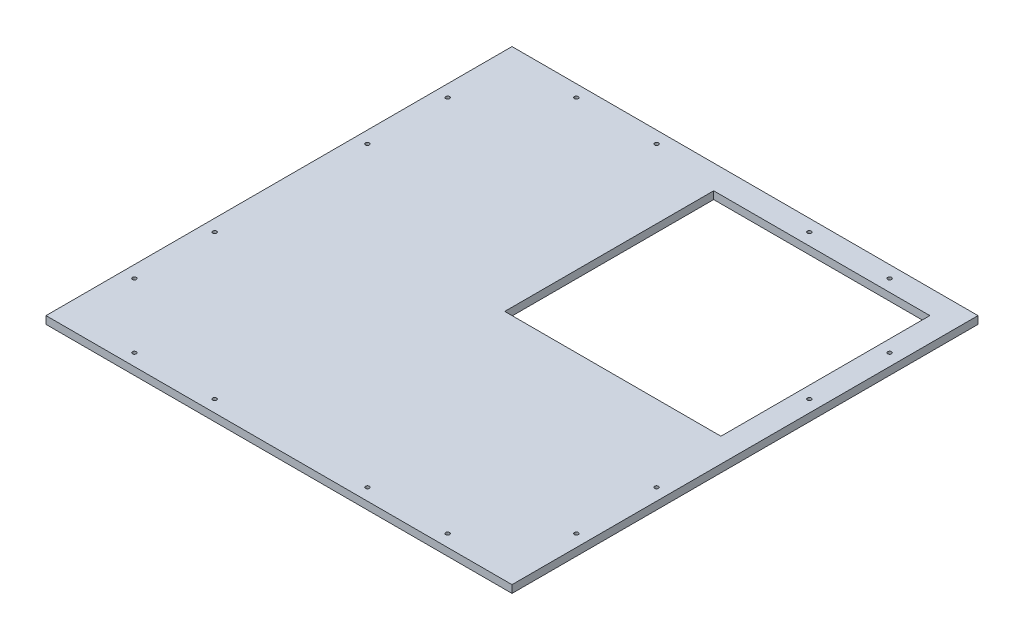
ISO-10303-21;
HEADER;
FILE_DESCRIPTION(('STEP AP214'),'2;1');
FILE_NAME('part.step','',(''),(''),'','','');
FILE_SCHEMA(('AUTOMOTIVE_DESIGN { 1 0 10303 214 1 1 1 1 }'));
ENDSEC;
DATA;
#1=APPLICATION_CONTEXT('core data for automotive mechanical design processes');
#2=APPLICATION_PROTOCOL_DEFINITION('international standard','automotive_design',2000,#1);
#3=PRODUCT_CONTEXT('',#1,'mechanical');
#4=PRODUCT('Part','Part','',(#3));
#5=PRODUCT_RELATED_PRODUCT_CATEGORY('part','',(#4));
#6=PRODUCT_DEFINITION_FORMATION('','',#4);
#7=PRODUCT_DEFINITION_CONTEXT('part definition',#1,'design');
#8=PRODUCT_DEFINITION('design','',#6,#7);
#9=PRODUCT_DEFINITION_SHAPE('','',#8);
#10=(LENGTH_UNIT() NAMED_UNIT(*) SI_UNIT(.MILLI.,.METRE.));
#11=(NAMED_UNIT(*) PLANE_ANGLE_UNIT() SI_UNIT($,.RADIAN.));
#12=(NAMED_UNIT(*) SI_UNIT($,.STERADIAN.) SOLID_ANGLE_UNIT());
#13=UNCERTAINTY_MEASURE_WITH_UNIT(LENGTH_MEASURE(1.E-05),#10,'distance_accuracy_value','');
#14=(GEOMETRIC_REPRESENTATION_CONTEXT(3) GLOBAL_UNCERTAINTY_ASSIGNED_CONTEXT((#13)) GLOBAL_UNIT_ASSIGNED_CONTEXT((#10,
#11,#12)) REPRESENTATION_CONTEXT('',''));
#15=CARTESIAN_POINT('',(0.,0.,0.));
#16=DIRECTION('',(0.,0.,1.));
#17=DIRECTION('',(1.,0.,0.));
#18=AXIS2_PLACEMENT_3D('',#15,#16,#17);
#19=CARTESIAN_POINT('',(0.,20.,0.));
#20=DIRECTION('',(1.,0.,0.));
#21=DIRECTION('',(0.,0.,-1.));
#22=AXIS2_PLACEMENT_3D('',#19,#20,#21);
#23=PLANE('',#22);
#24=DIRECTION('',(0.,0.,1.));
#25=VECTOR('',#24,1.);
#26=CARTESIAN_POINT('',(0.,0.,0.));
#27=LINE('',#26,#25);
#28=CARTESIAN_POINT('',(0.,0.,-1220.));
#29=VERTEX_POINT('',#28);
#30=CARTESIAN_POINT('',(0.,0.,0.));
#31=VERTEX_POINT('',#30);
#32=EDGE_CURVE('E136',#29,#31,#27,.T.);
#33=ORIENTED_EDGE('',*,*,#32,.T.);
#34=DIRECTION('',(0.,-1.,0.));
#35=VECTOR('',#34,1.);
#36=CARTESIAN_POINT('',(0.,20.,0.));
#37=LINE('',#36,#35);
#38=CARTESIAN_POINT('',(0.,20.,0.));
#39=VERTEX_POINT('',#38);
#40=EDGE_CURVE('E11',#39,#31,#37,.T.);
#41=ORIENTED_EDGE('',*,*,#40,.F.);
#42=DIRECTION('',(0.,0.,1.));
#43=VECTOR('',#42,1.);
#44=CARTESIAN_POINT('',(0.,20.,0.));
#45=LINE('',#44,#43);
#46=CARTESIAN_POINT('',(0.,20.,-1220.));
#47=VERTEX_POINT('',#46);
#48=EDGE_CURVE('E140',#47,#39,#45,.T.);
#49=ORIENTED_EDGE('',*,*,#48,.F.);
#50=DIRECTION('',(0.,-1.,0.));
#51=VECTOR('',#50,1.);
#52=CARTESIAN_POINT('',(0.,20.,-1220.));
#53=LINE('',#52,#51);
#54=EDGE_CURVE('E150',#47,#29,#53,.T.);
#55=ORIENTED_EDGE('',*,*,#54,.T.);
#56=EDGE_LOOP('',(#33,#41,#49,#55));
#57=FACE_BOUND('',#56,.T.);
#58=ADVANCED_FACE('F35',(#57),#23,.F.);
#59=CARTESIAN_POINT('',(0.,20.,0.));
#60=DIRECTION('',(0.,0.,-1.));
#61=DIRECTION('',(-1.,0.,0.));
#62=AXIS2_PLACEMENT_3D('',#59,#60,#61);
#63=PLANE('',#62);
#64=DIRECTION('',(1.,0.,0.));
#65=VECTOR('',#64,1.);
#66=CARTESIAN_POINT('',(0.,0.,0.));
#67=LINE('',#66,#65);
#68=CARTESIAN_POINT('',(1220.,0.,0.));
#69=VERTEX_POINT('',#68);
#70=EDGE_CURVE('E153',#31,#69,#67,.T.);
#71=ORIENTED_EDGE('',*,*,#70,.T.);
#72=DIRECTION('',(0.,-1.,0.));
#73=VECTOR('',#72,1.);
#74=CARTESIAN_POINT('',(1220.,20.,0.));
#75=LINE('',#74,#73);
#76=CARTESIAN_POINT('',(1220.,20.,0.));
#77=VERTEX_POINT('',#76);
#78=EDGE_CURVE('E42',#77,#69,#75,.T.);
#79=ORIENTED_EDGE('',*,*,#78,.F.);
#80=DIRECTION('',(1.,0.,0.));
#81=VECTOR('',#80,1.);
#82=CARTESIAN_POINT('',(0.,20.,0.));
#83=LINE('',#82,#81);
#84=EDGE_CURVE('E143',#39,#77,#83,.T.);
#85=ORIENTED_EDGE('',*,*,#84,.F.);
#86=ORIENTED_EDGE('',*,*,#40,.T.);
#87=EDGE_LOOP('',(#71,#79,#85,#86));
#88=FACE_BOUND('',#87,.T.);
#89=ADVANCED_FACE('F181',(#88),#63,.F.);
#90=CARTESIAN_POINT('',(1220.,20.,0.));
#91=DIRECTION('',(-1.,0.,0.));
#92=DIRECTION('',(0.,0.,1.));
#93=AXIS2_PLACEMENT_3D('',#90,#91,#92);
#94=PLANE('',#93);
#95=DIRECTION('',(0.,0.,-1.));
#96=VECTOR('',#95,1.);
#97=CARTESIAN_POINT('',(1220.,0.,0.));
#98=LINE('',#97,#96);
#99=CARTESIAN_POINT('',(1220.,0.,-1220.));
#100=VERTEX_POINT('',#99);
#101=EDGE_CURVE('E155',#69,#100,#98,.T.);
#102=ORIENTED_EDGE('',*,*,#101,.T.);
#103=DIRECTION('',(0.,-1.,0.));
#104=VECTOR('',#103,1.);
#105=CARTESIAN_POINT('',(1220.,20.,-1220.));
#106=LINE('',#105,#104);
#107=CARTESIAN_POINT('',(1220.,20.,-1220.));
#108=VERTEX_POINT('',#107);
#109=EDGE_CURVE('E160',#108,#100,#106,.T.);
#110=ORIENTED_EDGE('',*,*,#109,.F.);
#111=DIRECTION('',(0.,0.,-1.));
#112=VECTOR('',#111,1.);
#113=CARTESIAN_POINT('',(1220.,20.,0.));
#114=LINE('',#113,#112);
#115=EDGE_CURVE('E146',#77,#108,#114,.T.);
#116=ORIENTED_EDGE('',*,*,#115,.F.);
#117=ORIENTED_EDGE('',*,*,#78,.T.);
#118=EDGE_LOOP('',(#102,#110,#116,#117));
#119=FACE_BOUND('',#118,.T.);
#120=ADVANCED_FACE('F167',(#119),#94,.F.);
#121=CARTESIAN_POINT('',(0.,20.,-1220.));
#122=DIRECTION('',(0.,0.,1.));
#123=DIRECTION('',(1.,0.,0.));
#124=AXIS2_PLACEMENT_3D('',#121,#122,#123);
#125=PLANE('',#124);
#126=DIRECTION('',(-1.,0.,0.));
#127=VECTOR('',#126,1.);
#128=CARTESIAN_POINT('',(0.,0.,-1220.));
#129=LINE('',#128,#127);
#130=EDGE_CURVE('E144',#100,#29,#129,.T.);
#131=ORIENTED_EDGE('',*,*,#130,.T.);
#132=ORIENTED_EDGE('',*,*,#54,.F.);
#133=DIRECTION('',(-1.,0.,0.));
#134=VECTOR('',#133,1.);
#135=CARTESIAN_POINT('',(0.,20.,-1220.));
#136=LINE('',#135,#134);
#137=EDGE_CURVE('E148',#108,#47,#136,.T.);
#138=ORIENTED_EDGE('',*,*,#137,.F.);
#139=ORIENTED_EDGE('',*,*,#109,.T.);
#140=EDGE_LOOP('',(#131,#132,#138,#139));
#141=FACE_BOUND('',#140,.T.);
#142=ADVANCED_FACE('F174',(#141),#125,.F.);
#143=CARTESIAN_POINT('',(0.,20.,0.));
#144=DIRECTION('',(0.,-1.,0.));
#145=DIRECTION('',(0.,0.,-1.));
#146=AXIS2_PLACEMENT_3D('',#143,#144,#145);
#147=PLANE('',#146);
#148=CARTESIAN_POINT('',(200.,20.,-1188.5));
#149=DIRECTION('',(0.,1.,0.));
#150=DIRECTION('',(0.,0.,1.));
#151=AXIS2_PLACEMENT_3D('',#148,#149,#150);
#152=CIRCLE('',#151,5.00000000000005);
#153=CARTESIAN_POINT('',(200.,20.,-1183.5));
#154=VERTEX_POINT('',#153);
#155=EDGE_CURVE('E321',#154,#154,#152,.T.);
#156=ORIENTED_EDGE('',*,*,#155,.F.);
#157=EDGE_LOOP('',(#156));
#158=FACE_BOUND('',#157,.T.);
#159=CARTESIAN_POINT('',(31.5,20.,-1020.));
#160=DIRECTION('',(0.,1.,0.));
#161=DIRECTION('',(0.,0.,1.));
#162=AXIS2_PLACEMENT_3D('',#159,#160,#161);
#163=CIRCLE('',#162,5.00000000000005);
#164=CARTESIAN_POINT('',(31.5,20.,-1015.));
#165=VERTEX_POINT('',#164);
#166=EDGE_CURVE('E327',#165,#165,#163,.T.);
#167=ORIENTED_EDGE('',*,*,#166,.F.);
#168=EDGE_LOOP('',(#167));
#169=FACE_BOUND('',#168,.T.);
#170=CARTESIAN_POINT('',(31.5,20.,-810.));
#171=DIRECTION('',(0.,1.,0.));
#172=DIRECTION('',(0.,0.,1.));
#173=AXIS2_PLACEMENT_3D('',#170,#171,#172);
#174=CIRCLE('',#173,5.00000000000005);
#175=CARTESIAN_POINT('',(31.5,20.,-805.));
#176=VERTEX_POINT('',#175);
#177=EDGE_CURVE('E333',#176,#176,#174,.T.);
#178=ORIENTED_EDGE('',*,*,#177,.F.);
#179=EDGE_LOOP('',(#178));
#180=FACE_BOUND('',#179,.T.);
#181=CARTESIAN_POINT('',(31.5,20.,-410.));
#182=DIRECTION('',(0.,1.,0.));
#183=DIRECTION('',(0.,0.,1.));
#184=AXIS2_PLACEMENT_3D('',#181,#182,#183);
#185=CIRCLE('',#184,5.00000000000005);
#186=CARTESIAN_POINT('',(31.5,20.,-405.));
#187=VERTEX_POINT('',#186);
#188=EDGE_CURVE('E339',#187,#187,#185,.T.);
#189=ORIENTED_EDGE('',*,*,#188,.F.);
#190=EDGE_LOOP('',(#189));
#191=FACE_BOUND('',#190,.T.);
#192=CARTESIAN_POINT('',(31.4999999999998,20.,-200.));
#193=DIRECTION('',(0.,1.,0.));
#194=DIRECTION('',(0.,0.,1.));
#195=AXIS2_PLACEMENT_3D('',#192,#193,#194);
#196=CIRCLE('',#195,4.99999999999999);
#197=CARTESIAN_POINT('',(31.4999999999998,20.,-195.));
#198=VERTEX_POINT('',#197);
#199=EDGE_CURVE('E345',#198,#198,#196,.T.);
#200=ORIENTED_EDGE('',*,*,#199,.F.);
#201=EDGE_LOOP('',(#200));
#202=FACE_BOUND('',#201,.T.);
#203=CARTESIAN_POINT('',(200.,20.,-31.5));
#204=DIRECTION('',(0.,1.,0.));
#205=DIRECTION('',(0.,0.,1.));
#206=AXIS2_PLACEMENT_3D('',#203,#204,#205);
#207=CIRCLE('',#206,4.99999999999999);
#208=CARTESIAN_POINT('',(200.,20.,-26.5));
#209=VERTEX_POINT('',#208);
#210=EDGE_CURVE('E351',#209,#209,#207,.T.);
#211=ORIENTED_EDGE('',*,*,#210,.F.);
#212=EDGE_LOOP('',(#211));
#213=FACE_BOUND('',#212,.T.);
#214=CARTESIAN_POINT('',(410.,20.,-31.5));
#215=DIRECTION('',(0.,1.,0.));
#216=DIRECTION('',(0.,0.,1.));
#217=AXIS2_PLACEMENT_3D('',#214,#215,#216);
#218=CIRCLE('',#217,5.00000000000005);
#219=CARTESIAN_POINT('',(410.,20.,-26.5));
#220=VERTEX_POINT('',#219);
#221=EDGE_CURVE('E357',#220,#220,#218,.T.);
#222=ORIENTED_EDGE('',*,*,#221,.F.);
#223=EDGE_LOOP('',(#222));
#224=FACE_BOUND('',#223,.T.);
#225=CARTESIAN_POINT('',(810.,20.,-31.5));
#226=DIRECTION('',(0.,1.,0.));
#227=DIRECTION('',(0.,0.,1.));
#228=AXIS2_PLACEMENT_3D('',#225,#226,#227);
#229=CIRCLE('',#228,5.00000000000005);
#230=CARTESIAN_POINT('',(810.,20.,-26.5));
#231=VERTEX_POINT('',#230);
#232=EDGE_CURVE('E363',#231,#231,#229,.T.);
#233=ORIENTED_EDGE('',*,*,#232,.F.);
#234=EDGE_LOOP('',(#233));
#235=FACE_BOUND('',#234,.T.);
#236=CARTESIAN_POINT('',(1188.5,20.,-810.));
#237=DIRECTION('',(0.,1.,0.));
#238=DIRECTION('',(0.,0.,1.));
#239=AXIS2_PLACEMENT_3D('',#236,#237,#238);
#240=CIRCLE('',#239,5.00000000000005);
#241=CARTESIAN_POINT('',(1188.5,20.,-805.));
#242=VERTEX_POINT('',#241);
#243=EDGE_CURVE('E286',#242,#242,#240,.T.);
#244=ORIENTED_EDGE('',*,*,#243,.F.);
#245=EDGE_LOOP('',(#244));
#246=FACE_BOUND('',#245,.T.);
#247=CARTESIAN_POINT('',(1188.5,20.,-200.));
#248=DIRECTION('',(0.,1.,0.));
#249=DIRECTION('',(0.,0.,1.));
#250=AXIS2_PLACEMENT_3D('',#247,#248,#249);
#251=CIRCLE('',#250,5.00000000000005);
#252=CARTESIAN_POINT('',(1188.5,20.,-195.));
#253=VERTEX_POINT('',#252);
#254=EDGE_CURVE('E279',#253,#253,#251,.T.);
#255=ORIENTED_EDGE('',*,*,#254,.F.);
#256=EDGE_LOOP('',(#255));
#257=FACE_BOUND('',#256,.T.);
#258=CARTESIAN_POINT('',(1188.5,20.,-410.));
#259=DIRECTION('',(0.,1.,0.));
#260=DIRECTION('',(0.,0.,1.));
#261=AXIS2_PLACEMENT_3D('',#258,#259,#260);
#262=CIRCLE('',#261,5.00000000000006);
#263=CARTESIAN_POINT('',(1188.5,20.,-405.));
#264=VERTEX_POINT('',#263);
#265=EDGE_CURVE('E284',#264,#264,#262,.T.);
#266=ORIENTED_EDGE('',*,*,#265,.F.);
#267=EDGE_LOOP('',(#266));
#268=FACE_BOUND('',#267,.T.);
#269=CARTESIAN_POINT('',(1020.,20.,-31.5));
#270=DIRECTION('',(0.,1.,0.));
#271=DIRECTION('',(0.,0.,1.));
#272=AXIS2_PLACEMENT_3D('',#269,#270,#271);
#273=CIRCLE('',#272,5.00000000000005);
#274=CARTESIAN_POINT('',(1020.,20.,-26.4999999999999));
#275=VERTEX_POINT('',#274);
#276=EDGE_CURVE('E295',#275,#275,#273,.T.);
#277=ORIENTED_EDGE('',*,*,#276,.F.);
#278=EDGE_LOOP('',(#277));
#279=FACE_BOUND('',#278,.T.);
#280=CARTESIAN_POINT('',(1188.5,20.,-1020.));
#281=DIRECTION('',(0.,1.,0.));
#282=DIRECTION('',(0.,0.,1.));
#283=AXIS2_PLACEMENT_3D('',#280,#281,#282);
#284=CIRCLE('',#283,5.00000000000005);
#285=CARTESIAN_POINT('',(1188.5,20.,-1015.));
#286=VERTEX_POINT('',#285);
#287=EDGE_CURVE('E294',#286,#286,#284,.T.);
#288=ORIENTED_EDGE('',*,*,#287,.F.);
#289=EDGE_LOOP('',(#288));
#290=FACE_BOUND('',#289,.T.);
#291=CARTESIAN_POINT('',(1020.,20.,-1188.5));
#292=DIRECTION('',(0.,1.,0.));
#293=DIRECTION('',(0.,0.,1.));
#294=AXIS2_PLACEMENT_3D('',#291,#292,#293);
#295=CIRCLE('',#294,5.00000000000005);
#296=CARTESIAN_POINT('',(1020.,20.,-1183.5));
#297=VERTEX_POINT('',#296);
#298=EDGE_CURVE('E309',#297,#297,#295,.T.);
#299=ORIENTED_EDGE('',*,*,#298,.F.);
#300=EDGE_LOOP('',(#299));
#301=FACE_BOUND('',#300,.T.);
#302=CARTESIAN_POINT('',(810.,20.,-1188.5));
#303=DIRECTION('',(0.,1.,0.));
#304=DIRECTION('',(0.,0.,1.));
#305=AXIS2_PLACEMENT_3D('',#302,#303,#304);
#306=CIRCLE('',#305,5.00000000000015);
#307=CARTESIAN_POINT('',(810.,20.,-1183.5));
#308=VERTEX_POINT('',#307);
#309=EDGE_CURVE('E315',#308,#308,#306,.T.);
#310=ORIENTED_EDGE('',*,*,#309,.F.);
#311=EDGE_LOOP('',(#310));
#312=FACE_BOUND('',#311,.T.);
#313=CARTESIAN_POINT('',(410.,20.,-1188.5));
#314=DIRECTION('',(0.,1.,0.));
#315=DIRECTION('',(0.,0.,1.));
#316=AXIS2_PLACEMENT_3D('',#313,#314,#315);
#317=CIRCLE('',#316,5.0000000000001);
#318=CARTESIAN_POINT('',(410.,20.,-1183.5));
#319=VERTEX_POINT('',#318);
#320=EDGE_CURVE('E130',#319,#319,#317,.T.);
#321=ORIENTED_EDGE('',*,*,#320,.F.);
#322=EDGE_LOOP('',(#321));
#323=FACE_BOUND('',#322,.T.);
#324=DIRECTION('',(1.,0.,0.));
#325=VECTOR('',#324,1.);
#326=CARTESIAN_POINT('',(591.,20.,-610.));
#327=LINE('',#326,#325);
#328=CARTESIAN_POINT('',(591.,20.,-610.));
#329=VERTEX_POINT('',#328);
#330=CARTESIAN_POINT('',(1157.,20.,-610.));
#331=VERTEX_POINT('',#330);
#332=EDGE_CURVE('E129',#329,#331,#327,.T.);
#333=ORIENTED_EDGE('',*,*,#332,.F.);
#334=DIRECTION('',(0.,0.,1.));
#335=VECTOR('',#334,1.);
#336=CARTESIAN_POINT('',(591.,20.,-1157.));
#337=LINE('',#336,#335);
#338=CARTESIAN_POINT('',(591.,20.,-1157.));
#339=VERTEX_POINT('',#338);
#340=EDGE_CURVE('E49',#339,#329,#337,.T.);
#341=ORIENTED_EDGE('',*,*,#340,.F.);
#342=DIRECTION('',(-1.,0.,0.));
#343=VECTOR('',#342,1.);
#344=CARTESIAN_POINT('',(591.,20.,-1157.));
#345=LINE('',#344,#343);
#346=CARTESIAN_POINT('',(1157.,20.,-1157.));
#347=VERTEX_POINT('',#346);
#348=EDGE_CURVE('E117',#347,#339,#345,.T.);
#349=ORIENTED_EDGE('',*,*,#348,.F.);
#350=DIRECTION('',(0.,0.,-1.));
#351=VECTOR('',#350,1.);
#352=CARTESIAN_POINT('',(1157.,20.,-1157.));
#353=LINE('',#352,#351);
#354=EDGE_CURVE('E120',#331,#347,#353,.T.);
#355=ORIENTED_EDGE('',*,*,#354,.F.);
#356=EDGE_LOOP('',(#333,#341,#349,#355));
#357=FACE_BOUND('',#356,.T.);
#358=ORIENTED_EDGE('',*,*,#48,.T.);
#359=ORIENTED_EDGE('',*,*,#84,.T.);
#360=ORIENTED_EDGE('',*,*,#115,.T.);
#361=ORIENTED_EDGE('',*,*,#137,.T.);
#362=EDGE_LOOP('',(#358,#359,#360,#361));
#363=FACE_BOUND('',#362,.T.);
#364=ADVANCED_FACE('F180',(#158,#169,#180,#191,#202,#213,#224,#235,#246,#257,#268,#279,#290,
#301,#312,#323,#357,#363),#147,.F.);
#365=CARTESIAN_POINT('',(0.,0.,0.));
#366=DIRECTION('',(0.,-1.,0.));
#367=DIRECTION('',(0.,0.,-1.));
#368=AXIS2_PLACEMENT_3D('',#365,#366,#367);
#369=PLANE('',#368);
#370=CARTESIAN_POINT('',(200.,0.,-1188.5));
#371=DIRECTION('',(0.,-1.,0.));
#372=DIRECTION('',(0.,0.,-1.));
#373=AXIS2_PLACEMENT_3D('',#370,#371,#372);
#374=CIRCLE('',#373,5.00000000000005);
#375=CARTESIAN_POINT('',(200.,0.,-1193.5));
#376=VERTEX_POINT('',#375);
#377=EDGE_CURVE('E324',#376,#376,#374,.F.);
#378=ORIENTED_EDGE('',*,*,#377,.T.);
#379=EDGE_LOOP('',(#378));
#380=FACE_BOUND('',#379,.T.);
#381=CARTESIAN_POINT('',(31.5,0.,-1020.));
#382=DIRECTION('',(0.,-1.,0.));
#383=DIRECTION('',(0.,0.,-1.));
#384=AXIS2_PLACEMENT_3D('',#381,#382,#383);
#385=CIRCLE('',#384,5.00000000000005);
#386=CARTESIAN_POINT('',(31.5,0.,-1025.));
#387=VERTEX_POINT('',#386);
#388=EDGE_CURVE('E330',#387,#387,#385,.F.);
#389=ORIENTED_EDGE('',*,*,#388,.T.);
#390=EDGE_LOOP('',(#389));
#391=FACE_BOUND('',#390,.T.);
#392=CARTESIAN_POINT('',(31.5,0.,-810.));
#393=DIRECTION('',(0.,-1.,0.));
#394=DIRECTION('',(0.,0.,-1.));
#395=AXIS2_PLACEMENT_3D('',#392,#393,#394);
#396=CIRCLE('',#395,5.00000000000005);
#397=CARTESIAN_POINT('',(31.5,0.,-815.));
#398=VERTEX_POINT('',#397);
#399=EDGE_CURVE('E336',#398,#398,#396,.F.);
#400=ORIENTED_EDGE('',*,*,#399,.T.);
#401=EDGE_LOOP('',(#400));
#402=FACE_BOUND('',#401,.T.);
#403=CARTESIAN_POINT('',(31.5,0.,-410.));
#404=DIRECTION('',(0.,-1.,0.));
#405=DIRECTION('',(0.,0.,-1.));
#406=AXIS2_PLACEMENT_3D('',#403,#404,#405);
#407=CIRCLE('',#406,5.00000000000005);
#408=CARTESIAN_POINT('',(31.5,0.,-415.));
#409=VERTEX_POINT('',#408);
#410=EDGE_CURVE('E342',#409,#409,#407,.F.);
#411=ORIENTED_EDGE('',*,*,#410,.T.);
#412=EDGE_LOOP('',(#411));
#413=FACE_BOUND('',#412,.T.);
#414=CARTESIAN_POINT('',(31.4999999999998,0.,-200.));
#415=DIRECTION('',(0.,-1.,0.));
#416=DIRECTION('',(0.,0.,-1.));
#417=AXIS2_PLACEMENT_3D('',#414,#415,#416);
#418=CIRCLE('',#417,4.99999999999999);
#419=CARTESIAN_POINT('',(31.4999999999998,0.,-205.));
#420=VERTEX_POINT('',#419);
#421=EDGE_CURVE('E348',#420,#420,#418,.F.);
#422=ORIENTED_EDGE('',*,*,#421,.T.);
#423=EDGE_LOOP('',(#422));
#424=FACE_BOUND('',#423,.T.);
#425=CARTESIAN_POINT('',(200.,0.,-31.5));
#426=DIRECTION('',(0.,-1.,0.));
#427=DIRECTION('',(0.,0.,-1.));
#428=AXIS2_PLACEMENT_3D('',#425,#426,#427);
#429=CIRCLE('',#428,4.99999999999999);
#430=CARTESIAN_POINT('',(200.,0.,-36.5));
#431=VERTEX_POINT('',#430);
#432=EDGE_CURVE('E354',#431,#431,#429,.F.);
#433=ORIENTED_EDGE('',*,*,#432,.T.);
#434=EDGE_LOOP('',(#433));
#435=FACE_BOUND('',#434,.T.);
#436=CARTESIAN_POINT('',(410.,0.,-31.5));
#437=DIRECTION('',(0.,-1.,0.));
#438=DIRECTION('',(0.,0.,-1.));
#439=AXIS2_PLACEMENT_3D('',#436,#437,#438);
#440=CIRCLE('',#439,5.00000000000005);
#441=CARTESIAN_POINT('',(410.,0.,-36.5));
#442=VERTEX_POINT('',#441);
#443=EDGE_CURVE('E360',#442,#442,#440,.F.);
#444=ORIENTED_EDGE('',*,*,#443,.T.);
#445=EDGE_LOOP('',(#444));
#446=FACE_BOUND('',#445,.T.);
#447=CARTESIAN_POINT('',(810.,0.,-31.5));
#448=DIRECTION('',(0.,-1.,0.));
#449=DIRECTION('',(0.,0.,-1.));
#450=AXIS2_PLACEMENT_3D('',#447,#448,#449);
#451=CIRCLE('',#450,5.00000000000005);
#452=CARTESIAN_POINT('',(810.,0.,-36.5));
#453=VERTEX_POINT('',#452);
#454=EDGE_CURVE('E298',#453,#453,#451,.F.);
#455=ORIENTED_EDGE('',*,*,#454,.T.);
#456=EDGE_LOOP('',(#455));
#457=FACE_BOUND('',#456,.T.);
#458=CARTESIAN_POINT('',(1188.5,0.,-810.));
#459=DIRECTION('',(0.,-1.,0.));
#460=DIRECTION('',(0.,0.,-1.));
#461=AXIS2_PLACEMENT_3D('',#458,#459,#460);
#462=CIRCLE('',#461,5.00000000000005);
#463=CARTESIAN_POINT('',(1188.5,0.,-815.));
#464=VERTEX_POINT('',#463);
#465=EDGE_CURVE('E291',#464,#464,#462,.F.);
#466=ORIENTED_EDGE('',*,*,#465,.T.);
#467=EDGE_LOOP('',(#466));
#468=FACE_BOUND('',#467,.T.);
#469=CARTESIAN_POINT('',(1188.5,0.,-200.));
#470=DIRECTION('',(0.,-1.,0.));
#471=DIRECTION('',(0.,0.,-1.));
#472=AXIS2_PLACEMENT_3D('',#469,#470,#471);
#473=CIRCLE('',#472,5.00000000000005);
#474=CARTESIAN_POINT('',(1188.5,0.,-205.));
#475=VERTEX_POINT('',#474);
#476=EDGE_CURVE('E276',#475,#475,#473,.F.);
#477=ORIENTED_EDGE('',*,*,#476,.T.);
#478=EDGE_LOOP('',(#477));
#479=FACE_BOUND('',#478,.T.);
#480=CARTESIAN_POINT('',(1188.5,0.,-410.));
#481=DIRECTION('',(0.,-1.,0.));
#482=DIRECTION('',(0.,0.,-1.));
#483=AXIS2_PLACEMENT_3D('',#480,#481,#482);
#484=CIRCLE('',#483,5.00000000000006);
#485=CARTESIAN_POINT('',(1188.5,0.,-415.));
#486=VERTEX_POINT('',#485);
#487=EDGE_CURVE('E281',#486,#486,#484,.F.);
#488=ORIENTED_EDGE('',*,*,#487,.T.);
#489=EDGE_LOOP('',(#488));
#490=FACE_BOUND('',#489,.T.);
#491=CARTESIAN_POINT('',(1020.,0.,-31.5));
#492=DIRECTION('',(0.,-1.,0.));
#493=DIRECTION('',(0.,0.,-1.));
#494=AXIS2_PLACEMENT_3D('',#491,#492,#493);
#495=CIRCLE('',#494,5.00000000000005);
#496=CARTESIAN_POINT('',(1020.,0.,-36.5));
#497=VERTEX_POINT('',#496);
#498=EDGE_CURVE('E299',#497,#497,#495,.F.);
#499=ORIENTED_EDGE('',*,*,#498,.T.);
#500=EDGE_LOOP('',(#499));
#501=FACE_BOUND('',#500,.T.);
#502=CARTESIAN_POINT('',(1188.5,0.,-1020.));
#503=DIRECTION('',(0.,-1.,0.));
#504=DIRECTION('',(0.,0.,-1.));
#505=AXIS2_PLACEMENT_3D('',#502,#503,#504);
#506=CIRCLE('',#505,5.00000000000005);
#507=CARTESIAN_POINT('',(1188.5,0.,-1025.));
#508=VERTEX_POINT('',#507);
#509=EDGE_CURVE('E306',#508,#508,#506,.F.);
#510=ORIENTED_EDGE('',*,*,#509,.T.);
#511=EDGE_LOOP('',(#510));
#512=FACE_BOUND('',#511,.T.);
#513=CARTESIAN_POINT('',(1020.,0.,-1188.5));
#514=DIRECTION('',(0.,-1.,0.));
#515=DIRECTION('',(0.,0.,-1.));
#516=AXIS2_PLACEMENT_3D('',#513,#514,#515);
#517=CIRCLE('',#516,5.00000000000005);
#518=CARTESIAN_POINT('',(1020.,0.,-1193.5));
#519=VERTEX_POINT('',#518);
#520=EDGE_CURVE('E312',#519,#519,#517,.F.);
#521=ORIENTED_EDGE('',*,*,#520,.T.);
#522=EDGE_LOOP('',(#521));
#523=FACE_BOUND('',#522,.T.);
#524=CARTESIAN_POINT('',(810.,0.,-1188.5));
#525=DIRECTION('',(0.,-1.,0.));
#526=DIRECTION('',(0.,0.,-1.));
#527=AXIS2_PLACEMENT_3D('',#524,#525,#526);
#528=CIRCLE('',#527,5.00000000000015);
#529=CARTESIAN_POINT('',(810.,0.,-1193.5));
#530=VERTEX_POINT('',#529);
#531=EDGE_CURVE('E318',#530,#530,#528,.F.);
#532=ORIENTED_EDGE('',*,*,#531,.T.);
#533=EDGE_LOOP('',(#532));
#534=FACE_BOUND('',#533,.T.);
#535=CARTESIAN_POINT('',(410.,0.,-1188.5));
#536=DIRECTION('',(0.,-1.,0.));
#537=DIRECTION('',(0.,0.,-1.));
#538=AXIS2_PLACEMENT_3D('',#535,#536,#537);
#539=CIRCLE('',#538,5.0000000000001);
#540=CARTESIAN_POINT('',(410.,0.,-1193.5));
#541=VERTEX_POINT('',#540);
#542=EDGE_CURVE('E123',#541,#541,#539,.F.);
#543=ORIENTED_EDGE('',*,*,#542,.T.);
#544=EDGE_LOOP('',(#543));
#545=FACE_BOUND('',#544,.T.);
#546=DIRECTION('',(0.,0.,1.));
#547=VECTOR('',#546,1.);
#548=CARTESIAN_POINT('',(591.,0.,-1157.));
#549=LINE('',#548,#547);
#550=CARTESIAN_POINT('',(591.,0.,-1157.));
#551=VERTEX_POINT('',#550);
#552=CARTESIAN_POINT('',(591.,0.,-610.));
#553=VERTEX_POINT('',#552);
#554=EDGE_CURVE('E101',#551,#553,#549,.T.);
#555=ORIENTED_EDGE('',*,*,#554,.T.);
#556=DIRECTION('',(1.,0.,0.));
#557=VECTOR('',#556,1.);
#558=CARTESIAN_POINT('',(591.,0.,-610.));
#559=LINE('',#558,#557);
#560=CARTESIAN_POINT('',(1157.,0.,-610.));
#561=VERTEX_POINT('',#560);
#562=EDGE_CURVE('E110',#553,#561,#559,.T.);
#563=ORIENTED_EDGE('',*,*,#562,.T.);
#564=DIRECTION('',(0.,0.,-1.));
#565=VECTOR('',#564,1.);
#566=CARTESIAN_POINT('',(1157.,0.,-1157.));
#567=LINE('',#566,#565);
#568=CARTESIAN_POINT('',(1157.,0.,-1157.));
#569=VERTEX_POINT('',#568);
#570=EDGE_CURVE('E57',#561,#569,#567,.T.);
#571=ORIENTED_EDGE('',*,*,#570,.T.);
#572=DIRECTION('',(-1.,0.,0.));
#573=VECTOR('',#572,1.);
#574=CARTESIAN_POINT('',(591.,0.,-1157.));
#575=LINE('',#574,#573);
#576=EDGE_CURVE('E107',#569,#551,#575,.T.);
#577=ORIENTED_EDGE('',*,*,#576,.T.);
#578=EDGE_LOOP('',(#555,#563,#571,#577));
#579=FACE_BOUND('',#578,.T.);
#580=ORIENTED_EDGE('',*,*,#32,.F.);
#581=ORIENTED_EDGE('',*,*,#130,.F.);
#582=ORIENTED_EDGE('',*,*,#101,.F.);
#583=ORIENTED_EDGE('',*,*,#70,.F.);
#584=EDGE_LOOP('',(#580,#581,#582,#583));
#585=FACE_BOUND('',#584,.T.);
#586=ADVANCED_FACE('F114',(#380,#391,#402,#413,#424,#435,#446,#457,#468,#479,#490,#501,#512,
#523,#534,#545,#579,#585),#369,.T.);
#587=CARTESIAN_POINT('',(591.,0.,-1157.));
#588=DIRECTION('',(-1.,0.,0.));
#589=DIRECTION('',(0.,0.,1.));
#590=AXIS2_PLACEMENT_3D('',#587,#588,#589);
#591=PLANE('',#590);
#592=ORIENTED_EDGE('',*,*,#340,.T.);
#593=DIRECTION('',(0.,1.,0.));
#594=VECTOR('',#593,1.);
#595=CARTESIAN_POINT('',(591.,0.,-610.));
#596=LINE('',#595,#594);
#597=EDGE_CURVE('E97',#553,#329,#596,.T.);
#598=ORIENTED_EDGE('',*,*,#597,.F.);
#599=ORIENTED_EDGE('',*,*,#554,.F.);
#600=DIRECTION('',(0.,1.,0.));
#601=VECTOR('',#600,1.);
#602=CARTESIAN_POINT('',(591.,0.,-1157.));
#603=LINE('',#602,#601);
#604=EDGE_CURVE('E134',#551,#339,#603,.T.);
#605=ORIENTED_EDGE('',*,*,#604,.T.);
#606=EDGE_LOOP('',(#592,#598,#599,#605));
#607=FACE_BOUND('',#606,.T.);
#608=ADVANCED_FACE('F99',(#607),#591,.F.);
#609=CARTESIAN_POINT('',(591.,0.,-1157.));
#610=DIRECTION('',(0.,0.,-1.));
#611=DIRECTION('',(-1.,0.,0.));
#612=AXIS2_PLACEMENT_3D('',#609,#610,#611);
#613=PLANE('',#612);
#614=ORIENTED_EDGE('',*,*,#348,.T.);
#615=ORIENTED_EDGE('',*,*,#604,.F.);
#616=ORIENTED_EDGE('',*,*,#576,.F.);
#617=DIRECTION('',(0.,1.,0.));
#618=VECTOR('',#617,1.);
#619=CARTESIAN_POINT('',(1157.,0.,-1157.));
#620=LINE('',#619,#618);
#621=EDGE_CURVE('E137',#569,#347,#620,.T.);
#622=ORIENTED_EDGE('',*,*,#621,.T.);
#623=EDGE_LOOP('',(#614,#615,#616,#622));
#624=FACE_BOUND('',#623,.T.);
#625=ADVANCED_FACE('F199',(#624),#613,.F.);
#626=CARTESIAN_POINT('',(1157.,0.,-1157.));
#627=DIRECTION('',(1.,0.,0.));
#628=DIRECTION('',(0.,0.,-1.));
#629=AXIS2_PLACEMENT_3D('',#626,#627,#628);
#630=PLANE('',#629);
#631=ORIENTED_EDGE('',*,*,#354,.T.);
#632=ORIENTED_EDGE('',*,*,#621,.F.);
#633=ORIENTED_EDGE('',*,*,#570,.F.);
#634=DIRECTION('',(0.,1.,0.));
#635=VECTOR('',#634,1.);
#636=CARTESIAN_POINT('',(1157.,0.,-610.));
#637=LINE('',#636,#635);
#638=EDGE_CURVE('E106',#561,#331,#637,.T.);
#639=ORIENTED_EDGE('',*,*,#638,.T.);
#640=EDGE_LOOP('',(#631,#632,#633,#639));
#641=FACE_BOUND('',#640,.T.);
#642=ADVANCED_FACE('F203',(#641),#630,.F.);
#643=CARTESIAN_POINT('',(591.,0.,-610.));
#644=DIRECTION('',(0.,0.,1.));
#645=DIRECTION('',(1.,0.,0.));
#646=AXIS2_PLACEMENT_3D('',#643,#644,#645);
#647=PLANE('',#646);
#648=ORIENTED_EDGE('',*,*,#332,.T.);
#649=ORIENTED_EDGE('',*,*,#638,.F.);
#650=ORIENTED_EDGE('',*,*,#562,.F.);
#651=ORIENTED_EDGE('',*,*,#597,.T.);
#652=EDGE_LOOP('',(#648,#649,#650,#651));
#653=FACE_BOUND('',#652,.T.);
#654=ADVANCED_FACE('F111',(#653),#647,.F.);
#655=CARTESIAN_POINT('',(410.,-0.001000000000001,-1188.5));
#656=DIRECTION('',(0.,1.,0.));
#657=DIRECTION('',(0.,0.,1.));
#658=AXIS2_PLACEMENT_3D('',#655,#656,#657);
#659=CYLINDRICAL_SURFACE('',#658,5.0000000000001);
#660=ORIENTED_EDGE('',*,*,#542,.F.);
#661=EDGE_LOOP('',(#660));
#662=FACE_BOUND('',#661,.T.);
#663=ORIENTED_EDGE('',*,*,#320,.T.);
#664=EDGE_LOOP('',(#663));
#665=FACE_BOUND('',#664,.T.);
#666=ADVANCED_FACE('F202',(#662,#665),#659,.F.);
#667=CARTESIAN_POINT('',(810.,-0.001000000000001,-1188.5));
#668=DIRECTION('',(0.,1.,0.));
#669=DIRECTION('',(0.,0.,1.));
#670=AXIS2_PLACEMENT_3D('',#667,#668,#669);
#671=CYLINDRICAL_SURFACE('',#670,5.00000000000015);
#672=ORIENTED_EDGE('',*,*,#531,.F.);
#673=EDGE_LOOP('',(#672));
#674=FACE_BOUND('',#673,.T.);
#675=ORIENTED_EDGE('',*,*,#309,.T.);
#676=EDGE_LOOP('',(#675));
#677=FACE_BOUND('',#676,.T.);
#678=ADVANCED_FACE('F211',(#674,#677),#671,.F.);
#679=CARTESIAN_POINT('',(1020.,-0.001000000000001,-1188.5));
#680=DIRECTION('',(0.,1.,0.));
#681=DIRECTION('',(0.,0.,1.));
#682=AXIS2_PLACEMENT_3D('',#679,#680,#681);
#683=CYLINDRICAL_SURFACE('',#682,5.00000000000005);
#684=ORIENTED_EDGE('',*,*,#520,.F.);
#685=EDGE_LOOP('',(#684));
#686=FACE_BOUND('',#685,.T.);
#687=ORIENTED_EDGE('',*,*,#298,.T.);
#688=EDGE_LOOP('',(#687));
#689=FACE_BOUND('',#688,.T.);
#690=ADVANCED_FACE('F248',(#686,#689),#683,.F.);
#691=CARTESIAN_POINT('',(1188.5,-0.001000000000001,-1020.));
#692=DIRECTION('',(0.,1.,0.));
#693=DIRECTION('',(0.,0.,1.));
#694=AXIS2_PLACEMENT_3D('',#691,#692,#693);
#695=CYLINDRICAL_SURFACE('',#694,5.00000000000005);
#696=ORIENTED_EDGE('',*,*,#509,.F.);
#697=EDGE_LOOP('',(#696));
#698=FACE_BOUND('',#697,.T.);
#699=ORIENTED_EDGE('',*,*,#287,.T.);
#700=EDGE_LOOP('',(#699));
#701=FACE_BOUND('',#700,.T.);
#702=ADVANCED_FACE('F252',(#698,#701),#695,.F.);
#703=CARTESIAN_POINT('',(1020.,-0.001000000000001,-31.5));
#704=DIRECTION('',(0.,1.,0.));
#705=DIRECTION('',(0.,0.,1.));
#706=AXIS2_PLACEMENT_3D('',#703,#704,#705);
#707=CYLINDRICAL_SURFACE('',#706,5.00000000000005);
#708=ORIENTED_EDGE('',*,*,#498,.F.);
#709=EDGE_LOOP('',(#708));
#710=FACE_BOUND('',#709,.T.);
#711=ORIENTED_EDGE('',*,*,#276,.T.);
#712=EDGE_LOOP('',(#711));
#713=FACE_BOUND('',#712,.T.);
#714=ADVANCED_FACE('F256',(#710,#713),#707,.F.);
#715=CARTESIAN_POINT('',(1188.5,-0.001000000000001,-410.));
#716=DIRECTION('',(0.,1.,0.));
#717=DIRECTION('',(0.,0.,1.));
#718=AXIS2_PLACEMENT_3D('',#715,#716,#717);
#719=CYLINDRICAL_SURFACE('',#718,5.00000000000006);
#720=ORIENTED_EDGE('',*,*,#487,.F.);
#721=EDGE_LOOP('',(#720));
#722=FACE_BOUND('',#721,.T.);
#723=ORIENTED_EDGE('',*,*,#265,.T.);
#724=EDGE_LOOP('',(#723));
#725=FACE_BOUND('',#724,.T.);
#726=ADVANCED_FACE('F258',(#722,#725),#719,.F.);
#727=CARTESIAN_POINT('',(1188.5,-0.001000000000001,-200.));
#728=DIRECTION('',(0.,1.,0.));
#729=DIRECTION('',(0.,0.,1.));
#730=AXIS2_PLACEMENT_3D('',#727,#728,#729);
#731=CYLINDRICAL_SURFACE('',#730,5.00000000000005);
#732=ORIENTED_EDGE('',*,*,#476,.F.);
#733=EDGE_LOOP('',(#732));
#734=FACE_BOUND('',#733,.T.);
#735=ORIENTED_EDGE('',*,*,#254,.T.);
#736=EDGE_LOOP('',(#735));
#737=FACE_BOUND('',#736,.T.);
#738=ADVANCED_FACE('F261',(#734,#737),#731,.F.);
#739=CARTESIAN_POINT('',(1188.5,-0.001000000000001,-810.));
#740=DIRECTION('',(0.,1.,0.));
#741=DIRECTION('',(0.,0.,1.));
#742=AXIS2_PLACEMENT_3D('',#739,#740,#741);
#743=CYLINDRICAL_SURFACE('',#742,5.00000000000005);
#744=ORIENTED_EDGE('',*,*,#465,.F.);
#745=EDGE_LOOP('',(#744));
#746=FACE_BOUND('',#745,.T.);
#747=ORIENTED_EDGE('',*,*,#243,.T.);
#748=EDGE_LOOP('',(#747));
#749=FACE_BOUND('',#748,.T.);
#750=ADVANCED_FACE('F217',(#746,#749),#743,.F.);
#751=CARTESIAN_POINT('',(810.,-0.001000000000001,-31.5));
#752=DIRECTION('',(0.,1.,0.));
#753=DIRECTION('',(0.,0.,1.));
#754=AXIS2_PLACEMENT_3D('',#751,#752,#753);
#755=CYLINDRICAL_SURFACE('',#754,5.00000000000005);
#756=ORIENTED_EDGE('',*,*,#454,.F.);
#757=EDGE_LOOP('',(#756));
#758=FACE_BOUND('',#757,.T.);
#759=ORIENTED_EDGE('',*,*,#232,.T.);
#760=EDGE_LOOP('',(#759));
#761=FACE_BOUND('',#760,.T.);
#762=ADVANCED_FACE('F213',(#758,#761),#755,.F.);
#763=CARTESIAN_POINT('',(410.,-0.001000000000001,-31.5));
#764=DIRECTION('',(0.,1.,0.));
#765=DIRECTION('',(0.,0.,1.));
#766=AXIS2_PLACEMENT_3D('',#763,#764,#765);
#767=CYLINDRICAL_SURFACE('',#766,5.00000000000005);
#768=ORIENTED_EDGE('',*,*,#443,.F.);
#769=EDGE_LOOP('',(#768));
#770=FACE_BOUND('',#769,.T.);
#771=ORIENTED_EDGE('',*,*,#221,.T.);
#772=EDGE_LOOP('',(#771));
#773=FACE_BOUND('',#772,.T.);
#774=ADVANCED_FACE('F216',(#770,#773),#767,.F.);
#775=CARTESIAN_POINT('',(200.,-0.001000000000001,-31.5));
#776=DIRECTION('',(0.,1.,0.));
#777=DIRECTION('',(0.,0.,1.));
#778=AXIS2_PLACEMENT_3D('',#775,#776,#777);
#779=CYLINDRICAL_SURFACE('',#778,4.99999999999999);
#780=ORIENTED_EDGE('',*,*,#432,.F.);
#781=EDGE_LOOP('',(#780));
#782=FACE_BOUND('',#781,.T.);
#783=ORIENTED_EDGE('',*,*,#210,.T.);
#784=EDGE_LOOP('',(#783));
#785=FACE_BOUND('',#784,.T.);
#786=ADVANCED_FACE('F221',(#782,#785),#779,.F.);
#787=CARTESIAN_POINT('',(31.4999999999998,-0.001000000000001,-200.));
#788=DIRECTION('',(0.,1.,0.));
#789=DIRECTION('',(0.,0.,1.));
#790=AXIS2_PLACEMENT_3D('',#787,#788,#789);
#791=CYLINDRICAL_SURFACE('',#790,4.99999999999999);
#792=ORIENTED_EDGE('',*,*,#421,.F.);
#793=EDGE_LOOP('',(#792));
#794=FACE_BOUND('',#793,.T.);
#795=ORIENTED_EDGE('',*,*,#199,.T.);
#796=EDGE_LOOP('',(#795));
#797=FACE_BOUND('',#796,.T.);
#798=ADVANCED_FACE('F225',(#794,#797),#791,.F.);
#799=CARTESIAN_POINT('',(31.5,-0.001000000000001,-410.));
#800=DIRECTION('',(0.,1.,0.));
#801=DIRECTION('',(0.,0.,1.));
#802=AXIS2_PLACEMENT_3D('',#799,#800,#801);
#803=CYLINDRICAL_SURFACE('',#802,5.00000000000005);
#804=ORIENTED_EDGE('',*,*,#410,.F.);
#805=EDGE_LOOP('',(#804));
#806=FACE_BOUND('',#805,.T.);
#807=ORIENTED_EDGE('',*,*,#188,.T.);
#808=EDGE_LOOP('',(#807));
#809=FACE_BOUND('',#808,.T.);
#810=ADVANCED_FACE('F229',(#806,#809),#803,.F.);
#811=CARTESIAN_POINT('',(31.5,-0.001000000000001,-810.));
#812=DIRECTION('',(0.,1.,0.));
#813=DIRECTION('',(0.,0.,1.));
#814=AXIS2_PLACEMENT_3D('',#811,#812,#813);
#815=CYLINDRICAL_SURFACE('',#814,5.00000000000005);
#816=ORIENTED_EDGE('',*,*,#399,.F.);
#817=EDGE_LOOP('',(#816));
#818=FACE_BOUND('',#817,.T.);
#819=ORIENTED_EDGE('',*,*,#177,.T.);
#820=EDGE_LOOP('',(#819));
#821=FACE_BOUND('',#820,.T.);
#822=ADVANCED_FACE('F233',(#818,#821),#815,.F.);
#823=CARTESIAN_POINT('',(31.5,-0.001000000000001,-1020.));
#824=DIRECTION('',(0.,1.,0.));
#825=DIRECTION('',(0.,0.,1.));
#826=AXIS2_PLACEMENT_3D('',#823,#824,#825);
#827=CYLINDRICAL_SURFACE('',#826,5.00000000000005);
#828=ORIENTED_EDGE('',*,*,#388,.F.);
#829=EDGE_LOOP('',(#828));
#830=FACE_BOUND('',#829,.T.);
#831=ORIENTED_EDGE('',*,*,#166,.T.);
#832=EDGE_LOOP('',(#831));
#833=FACE_BOUND('',#832,.T.);
#834=ADVANCED_FACE('F237',(#830,#833),#827,.F.);
#835=CARTESIAN_POINT('',(200.,-0.001000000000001,-1188.5));
#836=DIRECTION('',(0.,1.,0.));
#837=DIRECTION('',(0.,0.,1.));
#838=AXIS2_PLACEMENT_3D('',#835,#836,#837);
#839=CYLINDRICAL_SURFACE('',#838,5.00000000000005);
#840=ORIENTED_EDGE('',*,*,#377,.F.);
#841=EDGE_LOOP('',(#840));
#842=FACE_BOUND('',#841,.T.);
#843=ORIENTED_EDGE('',*,*,#155,.T.);
#844=EDGE_LOOP('',(#843));
#845=FACE_BOUND('',#844,.T.);
#846=ADVANCED_FACE('F241',(#842,#845),#839,.F.);
#847=CLOSED_SHELL('',(#58,#89,#120,#142,#364,#586,#608,#625,#642,#654,#666,#678,#690,#702,#714,
#726,#738,#750,#762,#774,#786,#798,#810,#822,#834,#846));
#848=MANIFOLD_SOLID_BREP('B2',#847);
#849=ADVANCED_BREP_SHAPE_REPRESENTATION('',(#18,#848),#14);
#850=SHAPE_DEFINITION_REPRESENTATION(#9,#849);
ENDSEC;
END-ISO-10303-21;
